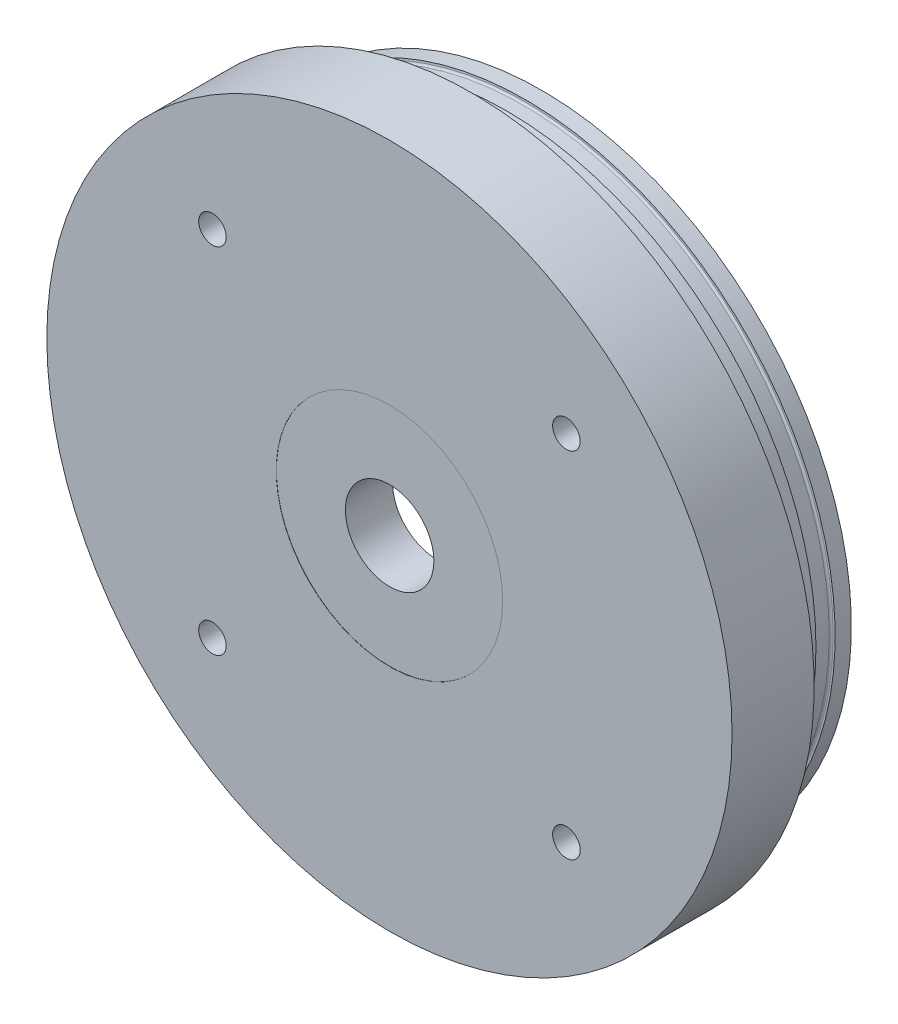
from build123d import *

# Parameters (mm, degrees)
SKETCH1_R                      = 43.0276
EXTRUDE1_DEPTH                 = 19.1262
SKETCH11_R                     = 56.973280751
SKETCH11_R_2                   = 38.8874
EXTRUDE9_DEPTH                 = 8.8138
SKETCH7_R                      = 14.224
EXTRUDE6_DEPTH                 = 0.0254
F_4_40_TAPPED_HOLE2_D          = 2.2606
F_4_40_TAPPED_HOLE2_DEPTH      = 11.43
F_4_40_TAPPED_HOLE2_TIP        = 0.679152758
CIRPATTERN2_COUNT              = 3
F_8_32_TAPPED_HOLE1_D          = 3.4544
F_8_32_TAPPED_HOLE1_DEPTH      = 12.446
F_8_32_TAPPED_HOLE1_TIP        = 1.037806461
CIRPATTERN1_COUNT              = 3
F_7_16_0_4375_DIAMETER_HOLE1_D = 11.1125


with BuildPart() as part:
    # Sketch1 → Extrude1 (new body)
    with BuildSketch(Plane.XY):
        Circle(SKETCH1_R)
    extrude(amount=EXTRUDE1_DEPTH)

    # Sketch5 → 4-40 Tapped Hole1 (revolve, cut)
    with BuildSketch(Plane(origin=(0, 32.639, 0), x_dir=(0, 1, 0), z_dir=(1, 0, 0))):
        Polygon((0, 0), (0, 12.109152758), (1.1303, 11.43), (1.1303, 0), align=None)
    f_4_40_tapped_hole1 = revolve(axis=Axis((0, 32.639, -6.35), (0, 0, 1)), mode=Mode.SUBTRACT)

    # Sketch11 → Extrude9 (cut)
    with BuildSketch(Plane(origin=(0, 0, 0), x_dir=(-1, 0, 0), z_dir=(0, 0, -1))):
        Circle(SKETCH11_R)
        Circle(SKETCH11_R_2, mode=Mode.SUBTRACT)
    extrude(amount=-EXTRUDE9_DEPTH, mode=Mode.SUBTRACT)

    # Sketch7 → Extrude6 (cut)
    with BuildSketch(Plane.XY.offset(19.1262)):
        Circle(SKETCH7_R)
    extrude(amount=-EXTRUDE6_DEPTH, mode=Mode.SUBTRACT)

    # 4-40 Tapped Hole2
    with Locations(Plane(origin=(12.7, -31.303889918, 0), x_dir=(-1, 0, 0), z_dir=(0, 0, -1))):
        with Locations((0, 0), (25.4, 0)):
            Hole(F_4_40_TAPPED_HOLE2_D / 2, depth=F_4_40_TAPPED_HOLE2_DEPTH)
            with Locations((0, 0, -(F_4_40_TAPPED_HOLE2_DEPTH + F_4_40_TAPPED_HOLE2_TIP / 2))):  # 118° drill point
                Cone(0, F_4_40_TAPPED_HOLE2_D / 2, F_4_40_TAPPED_HOLE2_TIP, mode=Mode.SUBTRACT)

    # CirPattern2: 4-40 Tapped Hole1 ×3 about axis
    cirpattern2_axis = Axis((0, 0, 0), (0, 0, 1))
    for i in range(1, CIRPATTERN2_COUNT):
        add(f_4_40_tapped_hole1.rotate(cirpattern2_axis, i * 360 / CIRPATTERN2_COUNT), mode=Mode.SUBTRACT)

    # Sketch13 → Cut-Revolve1 (revolve, cut)
    with BuildSketch(Plane(origin=(0, 0, 0), x_dir=(1, 0, 0), z_dir=(0, 1, 0))):
        Polygon((0, -13.1826), (-14.125429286, -13.1826), (-14.125429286, -8.5852), (-28.575, 0), (0, 0), align=None)
    revolve(axis=Axis((0, 0, 0), (0, 0, 1)), mode=Mode.SUBTRACT)

    # 8-32 Tapped Hole1
    with Locations(Plane(origin=(-22.224985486, 22.224985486, 19.1262), x_dir=(1, 0, 0), z_dir=(0, 0, 1))):
        with Locations((0, 0), (44.45, 0), (0, -44.45), (44.45, -44.45)):
            Hole(F_8_32_TAPPED_HOLE1_D / 2, depth=F_8_32_TAPPED_HOLE1_DEPTH)
            with Locations((0, 0, -(F_8_32_TAPPED_HOLE1_DEPTH + F_8_32_TAPPED_HOLE1_TIP / 2))):  # 118° drill point
                Cone(0, F_8_32_TAPPED_HOLE1_D / 2, F_8_32_TAPPED_HOLE1_TIP, mode=Mode.SUBTRACT)

    # CirPattern1: 4-40 Tapped Hole1 ×3 about axis
    cirpattern1_axis = Axis((0, 0, 19.1262), (0, 0, -1))
    for i in range(1, CIRPATTERN1_COUNT):
        add(f_4_40_tapped_hole1.rotate(cirpattern1_axis, i * 360 / CIRPATTERN1_COUNT), mode=Mode.SUBTRACT)

    # Sketch18 → Groove for AS 568-041_ O-Ring1 (revolve, cut)
    with BuildSketch(Plane(origin=(0, 0, 8.8138), x_dir=(0, 1, 0), z_dir=(-1, 0, 0)), mode=Mode.PRIVATE) as groove_for_as_568_041_o_ring1_sk:
        with BuildLine():
            Line((38.649362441, 6.750346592), (39.7764, 6.848949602))
            Line((39.7764, 6.848949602), (39.7764, 4.289543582))
            Line((39.7764, 4.289543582), (38.649362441, 4.388146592))
            ThreePointArc((38.649362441, 4.388146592), (38.484231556, 4.469580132), (38.4175, 4.641180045))
            Line((38.4175, 4.641180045), (38.4175, 6.497313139))
            ThreePointArc((38.4175, 6.497313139), (38.484231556, 6.668913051), (38.649362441, 6.750346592))
        make_face()
    revolve(groove_for_as_568_041_o_ring1_sk.sketch.rotate(Axis((0, 0, -41.1862), (0, 0, 1)), 90), axis=Axis((0, 0, -41.1862), (0, 0, 1)), mode=Mode.SUBTRACT)

    # Sketch21 → Groove for AS 568-041_ O-Ring2 (revolve, cut)
    with BuildSketch(Plane(origin=(0, 0, 8.8138), x_dir=(0, 1, 0), z_dir=(-1, 0, 0)), mode=Mode.PRIVATE) as groove_for_as_568_041_o_ring2_sk:
        with BuildLine():
            Line((40.100269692, -1.088937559), (40.005, 0))
            Line((40.005, 0), (41.9227, 0))
            Line((41.9227, 0), (41.795423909, -1.207116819))
            ThreePointArc((41.795423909, -1.207116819), (41.754088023, -1.288193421), (41.669124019, -1.3208))
            Line((41.669124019, -1.3208), (40.353303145, -1.3208))
            ThreePointArc((40.353303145, -1.3208), (40.181703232, -1.254068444), (40.100269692, -1.088937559))
        make_face()
    revolve(groove_for_as_568_041_o_ring2_sk.sketch.rotate(Axis((0, 0, -41.1862), (0, 0, 1)), 270), axis=Axis((0, 0, -41.1862), (0, 0, 1)), mode=Mode.SUBTRACT)

    # 7_16 _0.4375_ Diameter Hole1 (through all)
    with Locations(Plane.XY.offset(19.1262)):
        with Locations((0, 0)):
            Hole(F_7_16_0_4375_DIAMETER_HOLE1_D / 2)


solid = part.part
